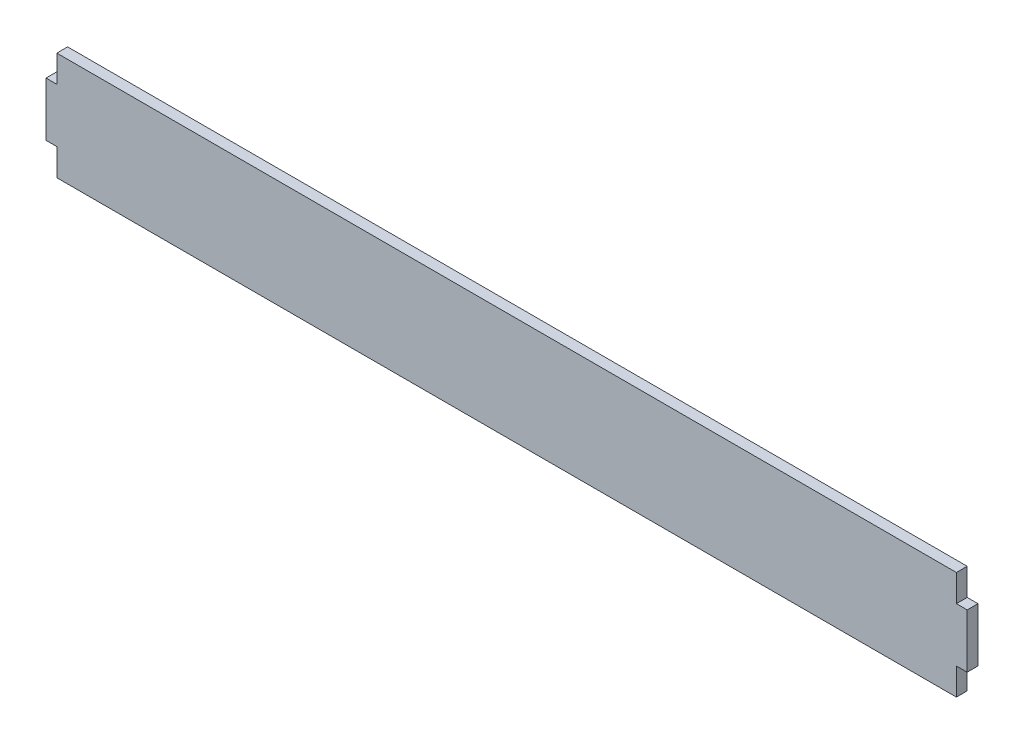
from build123d import *

# Parameters (mm, degrees)
SALIENTE_EXTRUIR1_DEPTH = 12


with BuildPart() as part:
    # Croquis1 → Saliente-Extruir1 (new body)
    with BuildSketch(Plane.XY):
        Polygon((500, 30), (512, 30), (512, -30), (500, -30), (500, -60), (-500, -60), (-500, -30), (-512, -30), (-512, 30), (-500, 30), (-500, 60), (500, 60), align=None)
    extrude(amount=SALIENTE_EXTRUIR1_DEPTH)


solid = part.part
